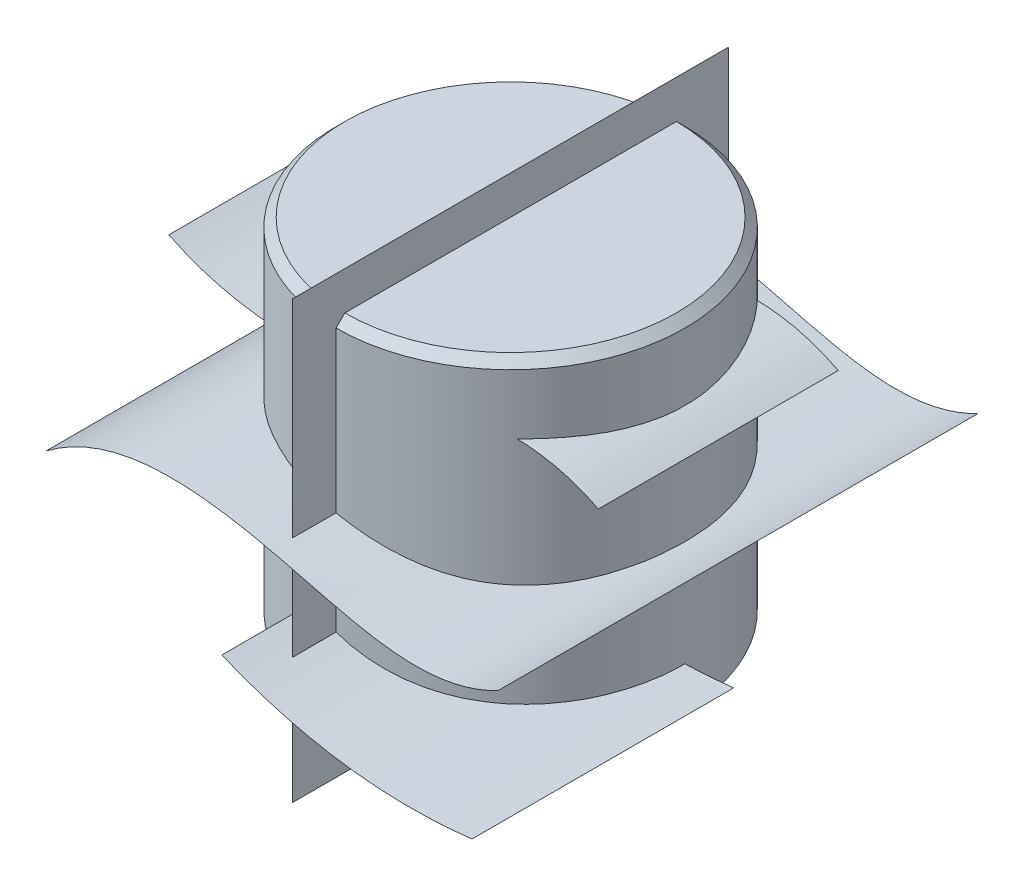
ISO-10303-21;
HEADER;
FILE_DESCRIPTION(('STEP AP214'),'2;1');
FILE_NAME('part.step','',(''),(''),'','','');
FILE_SCHEMA(('AUTOMOTIVE_DESIGN { 1 0 10303 214 1 1 1 1 }'));
ENDSEC;
DATA;
#1=APPLICATION_CONTEXT('core data for automotive mechanical design processes');
#2=APPLICATION_PROTOCOL_DEFINITION('international standard','automotive_design',2000,#1);
#3=PRODUCT_CONTEXT('',#1,'mechanical');
#4=PRODUCT('Part','Part','',(#3));
#5=PRODUCT_RELATED_PRODUCT_CATEGORY('part','',(#4));
#6=PRODUCT_DEFINITION_FORMATION('','',#4);
#7=PRODUCT_DEFINITION_CONTEXT('part definition',#1,'design');
#8=PRODUCT_DEFINITION('design','',#6,#7);
#9=PRODUCT_DEFINITION_SHAPE('','',#8);
#10=(LENGTH_UNIT() NAMED_UNIT(*) SI_UNIT(.MILLI.,.METRE.));
#11=(NAMED_UNIT(*) PLANE_ANGLE_UNIT() SI_UNIT($,.RADIAN.));
#12=(NAMED_UNIT(*) SI_UNIT($,.STERADIAN.) SOLID_ANGLE_UNIT());
#13=UNCERTAINTY_MEASURE_WITH_UNIT(LENGTH_MEASURE(1.E-05),#10,'distance_accuracy_value','');
#14=(GEOMETRIC_REPRESENTATION_CONTEXT(3) GLOBAL_UNCERTAINTY_ASSIGNED_CONTEXT((#13)) GLOBAL_UNIT_ASSIGNED_CONTEXT((#10,
#11,#12)) REPRESENTATION_CONTEXT('',''));
#15=CARTESIAN_POINT('',(0.,0.,0.));
#16=DIRECTION('',(0.,0.,1.));
#17=DIRECTION('',(1.,0.,0.));
#18=AXIS2_PLACEMENT_3D('',#15,#16,#17);
#19=CARTESIAN_POINT('',(0.,0.,0.));
#20=DIRECTION('',(1.,0.,0.));
#21=DIRECTION('',(0.,0.,-1.));
#22=AXIS2_PLACEMENT_3D('',#19,#20,#21);
#23=PLANE('',#22);
#24=DIRECTION('',(0.,1.,0.));
#25=VECTOR('',#24,1.);
#26=CARTESIAN_POINT('',(0.,88.7987992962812,-50.));
#27=LINE('',#26,#25);
#28=CARTESIAN_POINT('',(0.,-11.2012007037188,-50.));
#29=VERTEX_POINT('',#28);
#30=CARTESIAN_POINT('',(0.,88.7987992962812,-50.));
#31=VERTEX_POINT('',#30);
#32=EDGE_CURVE('E73',#29,#31,#27,.T.);
#33=ORIENTED_EDGE('',*,*,#32,.T.);
#34=DIRECTION('',(0.,0.,1.));
#35=VECTOR('',#34,1.);
#36=CARTESIAN_POINT('',(0.,88.7987992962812,50.));
#37=LINE('',#36,#35);
#38=CARTESIAN_POINT('',(0.,88.7987992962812,50.));
#39=VERTEX_POINT('',#38);
#40=EDGE_CURVE('E84',#31,#39,#37,.T.);
#41=ORIENTED_EDGE('',*,*,#40,.T.);
#42=DIRECTION('',(0.,-1.,0.));
#43=VECTOR('',#42,1.);
#44=CARTESIAN_POINT('',(0.,88.7987992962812,50.));
#45=LINE('',#44,#43);
#46=CARTESIAN_POINT('',(0.,-11.2012007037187,50.));
#47=VERTEX_POINT('',#46);
#48=EDGE_CURVE('E69',#39,#47,#45,.T.);
#49=ORIENTED_EDGE('',*,*,#48,.T.);
#50=DIRECTION('',(0.,0.,-1.));
#51=VECTOR('',#50,1.);
#52=CARTESIAN_POINT('',(0.,-11.2012007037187,50.));
#53=LINE('',#52,#51);
#54=EDGE_CURVE('E13',#47,#29,#53,.T.);
#55=ORIENTED_EDGE('',*,*,#54,.T.);
#56=EDGE_LOOP('',(#33,#41,#49,#55));
#57=FACE_BOUND('',#56,.T.);
#58=ADVANCED_FACE('F64',(#57),#23,.T.);
#59=OPEN_SHELL('',(#58));
#60=SHELL_BASED_SURFACE_MODEL('B2',(#59));
#61=CARTESIAN_POINT('',(-6.19574467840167,20.,0.));
#62=CARTESIAN_POINT('',(21.3433446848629,8.58388799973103,0.));
#63=CARTESIAN_POINT('',(51.1416086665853,12.1435405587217,0.));
#64=B_SPLINE_CURVE_WITH_KNOTS('',2,(#61,#62,#63),.UNSPECIFIED.,.F.,.F.,(3,3),(0.,1.),.UNSPECIFIED.);
#65=DIRECTION('',(0.,0.,1.));
#66=VECTOR('',#65,1.);
#67=SURFACE_OF_LINEAR_EXTRUSION('',#64,#66);
#68=CARTESIAN_POINT('',(-6.19574467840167,20.,60.));
#69=CARTESIAN_POINT('',(21.3433446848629,8.58388799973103,60.));
#70=CARTESIAN_POINT('',(51.1416086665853,12.1435405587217,60.));
#71=B_SPLINE_CURVE_WITH_KNOTS('',2,(#68,#69,#70),.UNSPECIFIED.,.F.,.F.,(3,3),(0.,1.),.UNSPECIFIED.);
#72=CARTESIAN_POINT('',(-6.19574467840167,20.,60.));
#73=VERTEX_POINT('',#72);
#74=CARTESIAN_POINT('',(51.1416086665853,12.1435405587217,60.));
#75=VERTEX_POINT('',#74);
#76=EDGE_CURVE('E136',#73,#75,#71,.T.);
#77=ORIENTED_EDGE('',*,*,#76,.F.);
#78=DIRECTION('',(0.,0.,1.));
#79=VECTOR('',#78,1.);
#80=CARTESIAN_POINT('',(-6.19574467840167,20.,0.));
#81=LINE('',#80,#79);
#82=CARTESIAN_POINT('',(-6.19574467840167,20.,0.));
#83=VERTEX_POINT('',#82);
#84=EDGE_CURVE('E118',#83,#73,#81,.T.);
#85=ORIENTED_EDGE('',*,*,#84,.F.);
#86=CARTESIAN_POINT('',(51.1416086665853,12.1435405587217,0.));
#87=VERTEX_POINT('',#86);
#88=EDGE_CURVE('E124',#83,#87,#64,.T.);
#89=ORIENTED_EDGE('',*,*,#88,.T.);
#90=DIRECTION('',(0.,0.,1.));
#91=VECTOR('',#90,1.);
#92=CARTESIAN_POINT('',(51.1416086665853,12.1435405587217,0.));
#93=LINE('',#92,#91);
#94=EDGE_CURVE('E62',#87,#75,#93,.T.);
#95=ORIENTED_EDGE('',*,*,#94,.T.);
#96=EDGE_LOOP('',(#77,#85,#89,#95));
#97=FACE_BOUND('',#96,.T.);
#98=ADVANCED_FACE('F116',(#97),#67,.T.);
#99=OPEN_SHELL('',(#98));
#100=SHELL_BASED_SURFACE_MODEL('B7',(#99));
#101=CARTESIAN_POINT('',(-51.4909062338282,35.3483752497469,-55.));
#102=CARTESIAN_POINT('',(-34.3684587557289,48.3931575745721,-55.));
#103=CARTESIAN_POINT('',(2.6374424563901,42.0526371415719,-55.));
#104=CARTESIAN_POINT('',(36.2705521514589,31.3363812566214,-55.));
#105=CARTESIAN_POINT('',(52.1335576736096,39.6057945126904,-55.));
#106=B_SPLINE_CURVE_WITH_KNOTS('',3,(#101,#102,#103,#104,#105),.UNSPECIFIED.,.F.,.F.,(4,1,4),
(0.,0.555418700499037,1.),.UNSPECIFIED.);
#107=DIRECTION('',(0.,0.,1.));
#108=VECTOR('',#107,1.);
#109=SURFACE_OF_LINEAR_EXTRUSION('',#106,#108);
#110=CARTESIAN_POINT('',(-51.4909062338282,35.3483752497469,55.));
#111=CARTESIAN_POINT('',(-34.3684587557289,48.3931575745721,55.));
#112=CARTESIAN_POINT('',(2.6374424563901,42.0526371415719,55.));
#113=CARTESIAN_POINT('',(36.2705521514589,31.3363812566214,55.));
#114=CARTESIAN_POINT('',(52.1335576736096,39.6057945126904,55.));
#115=B_SPLINE_CURVE_WITH_KNOTS('',3,(#110,#111,#112,#113,#114),.UNSPECIFIED.,.F.,.F.,(4,1,4),
(0.,0.555418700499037,1.),.UNSPECIFIED.);
#116=CARTESIAN_POINT('',(-51.4909062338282,35.3483752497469,55.));
#117=VERTEX_POINT('',#116);
#118=CARTESIAN_POINT('',(52.1335576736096,39.6057945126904,55.));
#119=VERTEX_POINT('',#118);
#120=EDGE_CURVE('E199',#117,#119,#115,.T.);
#121=ORIENTED_EDGE('',*,*,#120,.F.);
#122=DIRECTION('',(0.,0.,1.));
#123=VECTOR('',#122,1.);
#124=CARTESIAN_POINT('',(-51.4909062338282,35.3483752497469,-55.));
#125=LINE('',#124,#123);
#126=CARTESIAN_POINT('',(-51.4909062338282,35.3483752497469,-55.));
#127=VERTEX_POINT('',#126);
#128=EDGE_CURVE('E181',#127,#117,#125,.T.);
#129=ORIENTED_EDGE('',*,*,#128,.F.);
#130=CARTESIAN_POINT('',(52.1335576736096,39.6057945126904,-55.));
#131=VERTEX_POINT('',#130);
#132=EDGE_CURVE('E187',#127,#131,#106,.T.);
#133=ORIENTED_EDGE('',*,*,#132,.T.);
#134=DIRECTION('',(0.,0.,1.));
#135=VECTOR('',#134,1.);
#136=CARTESIAN_POINT('',(52.1335576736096,39.6057945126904,-55.));
#137=LINE('',#136,#135);
#138=EDGE_CURVE('E114',#131,#119,#137,.T.);
#139=ORIENTED_EDGE('',*,*,#138,.T.);
#140=EDGE_LOOP('',(#121,#129,#133,#139));
#141=FACE_BOUND('',#140,.T.);
#142=ADVANCED_FACE('F179',(#141),#109,.T.);
#143=OPEN_SHELL('',(#142));
#144=SHELL_BASED_SURFACE_MODEL('B56',(#143));
#145=CARTESIAN_POINT('',(-50.8450743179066,64.8349457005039,-27.5));
#146=CARTESIAN_POINT('',(-35.4670468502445,57.3362149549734,-27.5));
#147=CARTESIAN_POINT('',(-1.57412139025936,57.3524569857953,-27.5));
#148=CARTESIAN_POINT('',(30.8860616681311,68.302266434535,-27.5));
#149=CARTESIAN_POINT('',(47.5880358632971,59.6117229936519,-27.5));
#150=B_SPLINE_CURVE_WITH_KNOTS('',3,(#145,#146,#147,#148,#149),.UNSPECIFIED.,.F.,.F.,(4,1,4),
(0.,0.492109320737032,1.),.UNSPECIFIED.);
#151=DIRECTION('',(0.,0.,1.));
#152=VECTOR('',#151,1.);
#153=SURFACE_OF_LINEAR_EXTRUSION('',#150,#152);
#154=CARTESIAN_POINT('',(-50.8450743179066,64.8349457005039,27.5));
#155=CARTESIAN_POINT('',(-35.4670468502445,57.3362149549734,27.5));
#156=CARTESIAN_POINT('',(-1.57412139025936,57.3524569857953,27.5));
#157=CARTESIAN_POINT('',(30.8860616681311,68.302266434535,27.5));
#158=CARTESIAN_POINT('',(47.5880358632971,59.6117229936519,27.5));
#159=B_SPLINE_CURVE_WITH_KNOTS('',3,(#154,#155,#156,#157,#158),.UNSPECIFIED.,.F.,.F.,(4,1,4),
(0.,0.492109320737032,1.),.UNSPECIFIED.);
#160=CARTESIAN_POINT('',(-50.8450743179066,64.8349457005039,27.5));
#161=VERTEX_POINT('',#160);
#162=CARTESIAN_POINT('',(47.5880358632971,59.6117229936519,27.5));
#163=VERTEX_POINT('',#162);
#164=EDGE_CURVE('E259',#161,#163,#159,.T.);
#165=ORIENTED_EDGE('',*,*,#164,.F.);
#166=DIRECTION('',(0.,0.,1.));
#167=VECTOR('',#166,1.);
#168=CARTESIAN_POINT('',(-50.8450743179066,64.8349457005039,-27.5));
#169=LINE('',#168,#167);
#170=CARTESIAN_POINT('',(-50.8450743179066,64.8349457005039,-27.5));
#171=VERTEX_POINT('',#170);
#172=EDGE_CURVE('E241',#171,#161,#169,.T.);
#173=ORIENTED_EDGE('',*,*,#172,.F.);
#174=CARTESIAN_POINT('',(47.5880358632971,59.6117229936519,-27.5));
#175=VERTEX_POINT('',#174);
#176=EDGE_CURVE('E247',#171,#175,#150,.T.);
#177=ORIENTED_EDGE('',*,*,#176,.T.);
#178=DIRECTION('',(0.,0.,1.));
#179=VECTOR('',#178,1.);
#180=CARTESIAN_POINT('',(47.5880358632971,59.6117229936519,-27.5));
#181=LINE('',#180,#179);
#182=EDGE_CURVE('E177',#175,#163,#181,.T.);
#183=ORIENTED_EDGE('',*,*,#182,.T.);
#184=EDGE_LOOP('',(#165,#173,#177,#183));
#185=FACE_BOUND('',#184,.T.);
#186=ADVANCED_FACE('F239',(#185),#153,.T.);
#187=OPEN_SHELL('',(#186));
#188=SHELL_BASED_SURFACE_MODEL('B108',(#187));
#189=CARTESIAN_POINT('',(0.,80.,0.));
#190=DIRECTION('',(0.,-1.,0.));
#191=DIRECTION('',(0.,0.,-1.));
#192=AXIS2_PLACEMENT_3D('',#189,#190,#191);
#193=CYLINDRICAL_SURFACE('',#192,40.);
#194=CARTESIAN_POINT('',(0.,2.00000000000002,0.));
#195=DIRECTION('',(0.,1.,0.));
#196=DIRECTION('',(0.,0.,1.));
#197=AXIS2_PLACEMENT_3D('',#194,#195,#196);
#198=CIRCLE('',#197,40.);
#199=CARTESIAN_POINT('',(0.,2.00000000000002,40.));
#200=VERTEX_POINT('',#199);
#201=EDGE_CURVE('E306',#200,#200,#198,.T.);
#202=ORIENTED_EDGE('',*,*,#201,.T.);
#203=EDGE_LOOP('',(#202));
#204=FACE_BOUND('',#203,.T.);
#205=CARTESIAN_POINT('',(0.,78.,0.));
#206=DIRECTION('',(0.,1.,0.));
#207=DIRECTION('',(0.,0.,1.));
#208=AXIS2_PLACEMENT_3D('',#205,#206,#207);
#209=CIRCLE('',#208,40.);
#210=CARTESIAN_POINT('',(0.,78.,40.));
#211=VERTEX_POINT('',#210);
#212=EDGE_CURVE('E311',#211,#211,#209,.F.);
#213=ORIENTED_EDGE('',*,*,#212,.T.);
#214=EDGE_LOOP('',(#213));
#215=FACE_BOUND('',#214,.T.);
#216=ADVANCED_FACE('F292',(#204,#215),#193,.T.);
#217=CARTESIAN_POINT('',(0.,80.,0.));
#218=DIRECTION('',(0.,1.,0.));
#219=DIRECTION('',(0.,0.,1.));
#220=AXIS2_PLACEMENT_3D('',#217,#218,#219);
#221=PLANE('',#220);
#222=CARTESIAN_POINT('',(0.,80.,0.));
#223=DIRECTION('',(0.,1.,0.));
#224=DIRECTION('',(0.,0.,1.));
#225=AXIS2_PLACEMENT_3D('',#222,#223,#224);
#226=CIRCLE('',#225,38.);
#227=CARTESIAN_POINT('',(0.,80.,38.));
#228=VERTEX_POINT('',#227);
#229=EDGE_CURVE('E238',#228,#228,#226,.T.);
#230=ORIENTED_EDGE('',*,*,#229,.T.);
#231=EDGE_LOOP('',(#230));
#232=FACE_BOUND('',#231,.T.);
#233=ADVANCED_FACE('F328',(#232),#221,.T.);
#234=CARTESIAN_POINT('',(0.,0.,0.));
#235=DIRECTION('',(0.,1.,0.));
#236=DIRECTION('',(0.,0.,1.));
#237=AXIS2_PLACEMENT_3D('',#234,#235,#236);
#238=PLANE('',#237);
#239=CARTESIAN_POINT('',(0.,0.,0.));
#240=DIRECTION('',(0.,1.,0.));
#241=DIRECTION('',(0.,0.,1.));
#242=AXIS2_PLACEMENT_3D('',#239,#240,#241);
#243=CIRCLE('',#242,38.);
#244=CARTESIAN_POINT('',(0.,0.,38.));
#245=VERTEX_POINT('',#244);
#246=EDGE_CURVE('E301',#245,#245,#243,.F.);
#247=ORIENTED_EDGE('',*,*,#246,.T.);
#248=EDGE_LOOP('',(#247));
#249=FACE_BOUND('',#248,.T.);
#250=ADVANCED_FACE('F325',(#249),#238,.F.);
#251=CARTESIAN_POINT('',(0.,2.00000000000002,0.));
#252=DIRECTION('',(0.,1.,0.));
#253=DIRECTION('',(0.,0.,1.));
#254=AXIS2_PLACEMENT_3D('',#251,#252,#253);
#255=CONICAL_SURFACE('',#254,40.,0.785398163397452);
#256=ORIENTED_EDGE('',*,*,#246,.F.);
#257=EDGE_LOOP('',(#256));
#258=FACE_BOUND('',#257,.T.);
#259=ORIENTED_EDGE('',*,*,#201,.F.);
#260=EDGE_LOOP('',(#259));
#261=FACE_BOUND('',#260,.T.);
#262=ADVANCED_FACE('F321',(#258,#261),#255,.T.);
#263=CARTESIAN_POINT('',(0.,80.,0.));
#264=DIRECTION('',(0.,-1.,0.));
#265=DIRECTION('',(0.,0.,-1.));
#266=AXIS2_PLACEMENT_3D('',#263,#264,#265);
#267=CONICAL_SURFACE('',#266,38.,0.785398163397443);
#268=ORIENTED_EDGE('',*,*,#212,.F.);
#269=EDGE_LOOP('',(#268));
#270=FACE_BOUND('',#269,.T.);
#271=ORIENTED_EDGE('',*,*,#229,.F.);
#272=EDGE_LOOP('',(#271));
#273=FACE_BOUND('',#272,.T.);
#274=ADVANCED_FACE('F295',(#270,#273),#267,.T.);
#275=CLOSED_SHELL('',(#216,#233,#250,#262,#274));
#276=MANIFOLD_SOLID_BREP('B171',#275);
#277=ADVANCED_BREP_SHAPE_REPRESENTATION('',(#18,#276),#14);
#278=MANIFOLD_SURFACE_SHAPE_REPRESENTATION('',(#18,#60,#100,#144,#188),#14);
#279=SHAPE_REPRESENTATION('',(#18),#14);
#280=SHAPE_DEFINITION_REPRESENTATION(#9,#279);
#281=SHAPE_REPRESENTATION_RELATIONSHIP('','',#279,#277);
#282=SHAPE_REPRESENTATION_RELATIONSHIP('','',#279,#278);
ENDSEC;
END-ISO-10303-21;
